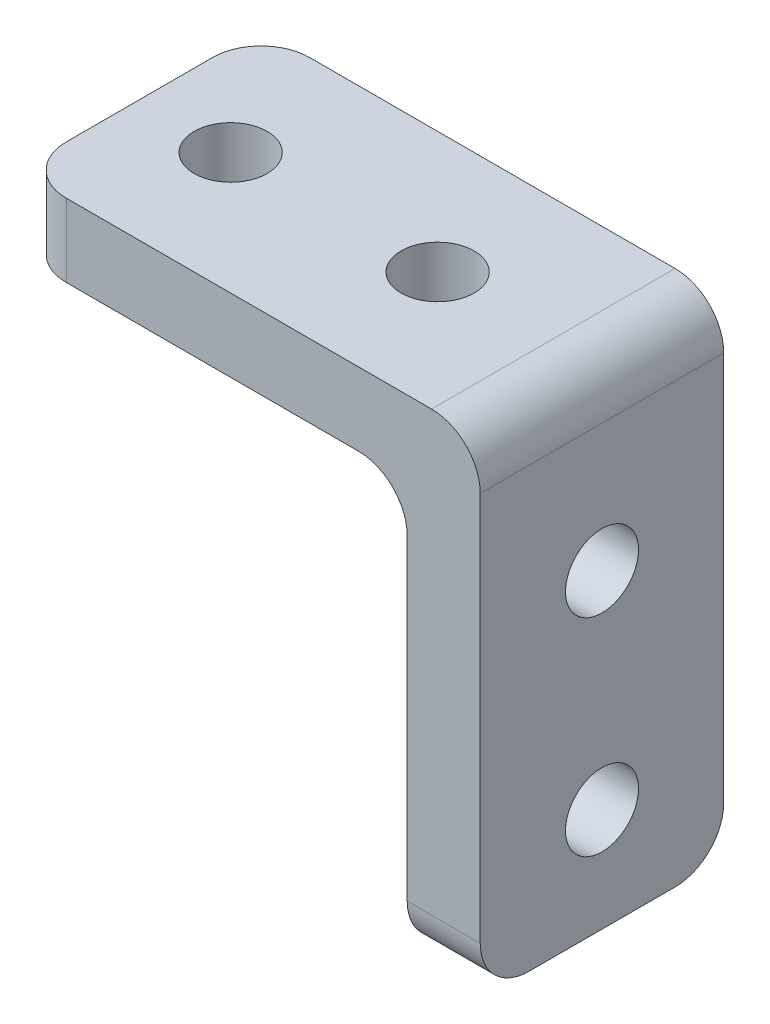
ISO-10303-21;
HEADER;
FILE_DESCRIPTION(('STEP AP214'),'2;1');
FILE_NAME('part.step','',(''),(''),'','','');
FILE_SCHEMA(('AUTOMOTIVE_DESIGN { 1 0 10303 214 1 1 1 1 }'));
ENDSEC;
DATA;
#1=APPLICATION_CONTEXT('core data for automotive mechanical design processes');
#2=APPLICATION_PROTOCOL_DEFINITION('international standard','automotive_design',2000,#1);
#3=PRODUCT_CONTEXT('',#1,'mechanical');
#4=PRODUCT('Part','Part','',(#3));
#5=PRODUCT_RELATED_PRODUCT_CATEGORY('part','',(#4));
#6=PRODUCT_DEFINITION_FORMATION('','',#4);
#7=PRODUCT_DEFINITION_CONTEXT('part definition',#1,'design');
#8=PRODUCT_DEFINITION('design','',#6,#7);
#9=PRODUCT_DEFINITION_SHAPE('','',#8);
#10=(LENGTH_UNIT() NAMED_UNIT(*) SI_UNIT(.MILLI.,.METRE.));
#11=(NAMED_UNIT(*) PLANE_ANGLE_UNIT() SI_UNIT($,.RADIAN.));
#12=(NAMED_UNIT(*) SI_UNIT($,.STERADIAN.) SOLID_ANGLE_UNIT());
#13=UNCERTAINTY_MEASURE_WITH_UNIT(LENGTH_MEASURE(1.E-05),#10,'distance_accuracy_value','');
#14=(GEOMETRIC_REPRESENTATION_CONTEXT(3) GLOBAL_UNCERTAINTY_ASSIGNED_CONTEXT((#13)) GLOBAL_UNIT_ASSIGNED_CONTEXT((#10,
#11,#12)) REPRESENTATION_CONTEXT('',''));
#15=CARTESIAN_POINT('',(0.,0.,0.));
#16=DIRECTION('',(0.,0.,1.));
#17=DIRECTION('',(1.,0.,0.));
#18=AXIS2_PLACEMENT_3D('',#15,#16,#17);
#19=CARTESIAN_POINT('',(0.,3.,0.));
#20=DIRECTION('',(0.,1.,0.));
#21=DIRECTION('',(0.,0.,1.));
#22=AXIS2_PLACEMENT_3D('',#19,#20,#21);
#23=PLANE('',#22);
#24=CARTESIAN_POINT('',(4.25,3.,0.));
#25=DIRECTION('',(0.,1.,0.));
#26=DIRECTION('',(0.,0.,1.));
#27=AXIS2_PLACEMENT_3D('',#24,#25,#26);
#28=CIRCLE('',#27,1.5);
#29=CARTESIAN_POINT('',(4.25,3.,1.5));
#30=VERTEX_POINT('',#29);
#31=EDGE_CURVE('E156',#30,#30,#28,.T.);
#32=ORIENTED_EDGE('',*,*,#31,.F.);
#33=EDGE_LOOP('',(#32));
#34=FACE_BOUND('',#33,.T.);
#35=DIRECTION('',(1.,0.,0.));
#36=VECTOR('',#35,1.);
#37=CARTESIAN_POINT('',(8.,3.,5.));
#38=LINE('',#37,#36);
#39=CARTESIAN_POINT('',(-6.,3.,5.));
#40=VERTEX_POINT('',#39);
#41=CARTESIAN_POINT('',(9.,3.,5.));
#42=VERTEX_POINT('',#41);
#43=EDGE_CURVE('E236',#40,#42,#38,.T.);
#44=ORIENTED_EDGE('',*,*,#43,.T.);
#45=DIRECTION('',(0.,0.,-1.));
#46=VECTOR('',#45,1.);
#47=CARTESIAN_POINT('',(9.,3.,0.));
#48=LINE('',#47,#46);
#49=CARTESIAN_POINT('',(9.,3.,-5.));
#50=VERTEX_POINT('',#49);
#51=EDGE_CURVE('E227',#42,#50,#48,.T.);
#52=ORIENTED_EDGE('',*,*,#51,.T.);
#53=DIRECTION('',(-1.,0.,0.));
#54=VECTOR('',#53,1.);
#55=CARTESIAN_POINT('',(8.,3.,-5.));
#56=LINE('',#55,#54);
#57=CARTESIAN_POINT('',(-6.,3.,-5.));
#58=VERTEX_POINT('',#57);
#59=EDGE_CURVE('E164',#50,#58,#56,.T.);
#60=ORIENTED_EDGE('',*,*,#59,.T.);
#61=CARTESIAN_POINT('',(-6.,3.,-3.));
#62=DIRECTION('',(0.,1.,0.));
#63=DIRECTION('',(0.,0.,1.));
#64=AXIS2_PLACEMENT_3D('',#61,#62,#63);
#65=CIRCLE('',#64,2.);
#66=CARTESIAN_POINT('',(-8.,3.,-3.));
#67=VERTEX_POINT('',#66);
#68=EDGE_CURVE('E225',#58,#67,#65,.T.);
#69=ORIENTED_EDGE('',*,*,#68,.T.);
#70=DIRECTION('',(0.,0.,1.));
#71=VECTOR('',#70,1.);
#72=CARTESIAN_POINT('',(-8.,3.,5.));
#73=LINE('',#72,#71);
#74=CARTESIAN_POINT('',(-8.,3.,3.));
#75=VERTEX_POINT('',#74);
#76=EDGE_CURVE('E138',#67,#75,#73,.T.);
#77=ORIENTED_EDGE('',*,*,#76,.T.);
#78=CARTESIAN_POINT('',(-6.,3.,3.));
#79=DIRECTION('',(0.,1.,0.));
#80=DIRECTION('',(0.,0.,1.));
#81=AXIS2_PLACEMENT_3D('',#78,#79,#80);
#82=CIRCLE('',#81,2.);
#83=EDGE_CURVE('E223',#75,#40,#82,.T.);
#84=ORIENTED_EDGE('',*,*,#83,.T.);
#85=EDGE_LOOP('',(#44,#52,#60,#69,#77,#84));
#86=FACE_BOUND('',#85,.T.);
#87=CARTESIAN_POINT('',(-4.25,3.,0.));
#88=DIRECTION('',(0.,1.,0.));
#89=DIRECTION('',(0.,0.,-1.));
#90=AXIS2_PLACEMENT_3D('',#87,#88,#89);
#91=CIRCLE('',#90,1.5);
#92=CARTESIAN_POINT('',(-4.25,3.,-1.5));
#93=VERTEX_POINT('',#92);
#94=EDGE_CURVE('E192',#93,#93,#91,.T.);
#95=ORIENTED_EDGE('',*,*,#94,.F.);
#96=EDGE_LOOP('',(#95));
#97=FACE_BOUND('',#96,.T.);
#98=ADVANCED_FACE('F32',(#34,#86,#97),#23,.T.);
#99=CARTESIAN_POINT('',(0.,0.,0.));
#100=DIRECTION('',(0.,1.,0.));
#101=DIRECTION('',(0.,0.,1.));
#102=AXIS2_PLACEMENT_3D('',#99,#100,#101);
#103=PLANE('',#102);
#104=CARTESIAN_POINT('',(4.25,0.,0.));
#105=DIRECTION('',(0.,1.,0.));
#106=DIRECTION('',(0.,0.,1.));
#107=AXIS2_PLACEMENT_3D('',#104,#105,#106);
#108=CIRCLE('',#107,1.5);
#109=CARTESIAN_POINT('',(4.25,0.,1.5));
#110=VERTEX_POINT('',#109);
#111=EDGE_CURVE('E160',#110,#110,#108,.T.);
#112=ORIENTED_EDGE('',*,*,#111,.T.);
#113=EDGE_LOOP('',(#112));
#114=FACE_BOUND('',#113,.T.);
#115=DIRECTION('',(-1.,0.,0.));
#116=VECTOR('',#115,1.);
#117=CARTESIAN_POINT('',(8.,0.,-5.));
#118=LINE('',#117,#116);
#119=CARTESIAN_POINT('',(6.,0.,-5.));
#120=VERTEX_POINT('',#119);
#121=CARTESIAN_POINT('',(-6.,0.,-5.));
#122=VERTEX_POINT('',#121);
#123=EDGE_CURVE('E125',#120,#122,#118,.T.);
#124=ORIENTED_EDGE('',*,*,#123,.F.);
#125=DIRECTION('',(0.,0.,-1.));
#126=VECTOR('',#125,1.);
#127=CARTESIAN_POINT('',(6.,0.,0.));
#128=LINE('',#127,#126);
#129=CARTESIAN_POINT('',(6.,0.,5.));
#130=VERTEX_POINT('',#129);
#131=EDGE_CURVE('E136',#120,#130,#128,.F.);
#132=ORIENTED_EDGE('',*,*,#131,.T.);
#133=DIRECTION('',(1.,0.,0.));
#134=VECTOR('',#133,1.);
#135=CARTESIAN_POINT('',(8.,0.,5.));
#136=LINE('',#135,#134);
#137=CARTESIAN_POINT('',(-6.,0.,5.));
#138=VERTEX_POINT('',#137);
#139=EDGE_CURVE('E139',#138,#130,#136,.T.);
#140=ORIENTED_EDGE('',*,*,#139,.F.);
#141=CARTESIAN_POINT('',(-6.,0.,3.));
#142=DIRECTION('',(0.,1.,0.));
#143=DIRECTION('',(0.,0.,1.));
#144=AXIS2_PLACEMENT_3D('',#141,#142,#143);
#145=CIRCLE('',#144,2.);
#146=CARTESIAN_POINT('',(-8.,0.,3.));
#147=VERTEX_POINT('',#146);
#148=EDGE_CURVE('E47',#138,#147,#145,.F.);
#149=ORIENTED_EDGE('',*,*,#148,.T.);
#150=DIRECTION('',(0.,0.,1.));
#151=VECTOR('',#150,1.);
#152=CARTESIAN_POINT('',(-8.,0.,5.));
#153=LINE('',#152,#151);
#154=CARTESIAN_POINT('',(-8.,0.,-3.));
#155=VERTEX_POINT('',#154);
#156=EDGE_CURVE('E152',#155,#147,#153,.T.);
#157=ORIENTED_EDGE('',*,*,#156,.F.);
#158=CARTESIAN_POINT('',(-6.,0.,-3.));
#159=DIRECTION('',(0.,1.,0.));
#160=DIRECTION('',(0.,0.,1.));
#161=AXIS2_PLACEMENT_3D('',#158,#159,#160);
#162=CIRCLE('',#161,2.);
#163=EDGE_CURVE('E55',#155,#122,#162,.F.);
#164=ORIENTED_EDGE('',*,*,#163,.T.);
#165=EDGE_LOOP('',(#124,#132,#140,#149,#157,#164));
#166=FACE_BOUND('',#165,.T.);
#167=CARTESIAN_POINT('',(-4.25,0.,0.));
#168=DIRECTION('',(0.,1.,0.));
#169=DIRECTION('',(0.,0.,-1.));
#170=AXIS2_PLACEMENT_3D('',#167,#168,#169);
#171=CIRCLE('',#170,1.5);
#172=CARTESIAN_POINT('',(-4.25,0.,-1.5));
#173=VERTEX_POINT('',#172);
#174=EDGE_CURVE('E175',#173,#173,#171,.T.);
#175=ORIENTED_EDGE('',*,*,#174,.T.);
#176=EDGE_LOOP('',(#175));
#177=FACE_BOUND('',#176,.T.);
#178=ADVANCED_FACE('F134',(#114,#166,#177),#103,.F.);
#179=CARTESIAN_POINT('',(-8.,3.,5.));
#180=DIRECTION('',(1.,0.,0.));
#181=DIRECTION('',(0.,0.,-1.));
#182=AXIS2_PLACEMENT_3D('',#179,#180,#181);
#183=PLANE('',#182);
#184=ORIENTED_EDGE('',*,*,#76,.F.);
#185=DIRECTION('',(0.,-1.,0.));
#186=VECTOR('',#185,1.);
#187=CARTESIAN_POINT('',(-8.,3.,-3.));
#188=LINE('',#187,#186);
#189=EDGE_CURVE('E133',#67,#155,#188,.T.);
#190=ORIENTED_EDGE('',*,*,#189,.T.);
#191=ORIENTED_EDGE('',*,*,#156,.T.);
#192=DIRECTION('',(0.,-1.,0.));
#193=VECTOR('',#192,1.);
#194=CARTESIAN_POINT('',(-8.,3.,3.));
#195=LINE('',#194,#193);
#196=EDGE_CURVE('E143',#147,#75,#195,.F.);
#197=ORIENTED_EDGE('',*,*,#196,.T.);
#198=EDGE_LOOP('',(#184,#190,#191,#197));
#199=FACE_BOUND('',#198,.T.);
#200=ADVANCED_FACE('F151',(#199),#183,.F.);
#201=CARTESIAN_POINT('',(8.,3.,5.));
#202=DIRECTION('',(0.,0.,-1.));
#203=DIRECTION('',(-1.,0.,0.));
#204=AXIS2_PLACEMENT_3D('',#201,#202,#203);
#205=PLANE('',#204);
#206=DIRECTION('',(0.,1.,0.));
#207=VECTOR('',#206,1.);
#208=CARTESIAN_POINT('',(8.,-17.,5.));
#209=LINE('',#208,#207);
#210=CARTESIAN_POINT('',(8.,-15.,5.));
#211=VERTEX_POINT('',#210);
#212=CARTESIAN_POINT('',(8.,-2.,5.));
#213=VERTEX_POINT('',#212);
#214=EDGE_CURVE('E189',#211,#213,#209,.T.);
#215=ORIENTED_EDGE('',*,*,#214,.F.);
#216=DIRECTION('',(1.,0.,0.));
#217=VECTOR('',#216,1.);
#218=CARTESIAN_POINT('',(8.,-15.,5.));
#219=LINE('',#218,#217);
#220=CARTESIAN_POINT('',(11.,-15.,5.));
#221=VERTEX_POINT('',#220);
#222=EDGE_CURVE('E220',#211,#221,#219,.T.);
#223=ORIENTED_EDGE('',*,*,#222,.T.);
#224=DIRECTION('',(0.,1.,0.));
#225=VECTOR('',#224,1.);
#226=CARTESIAN_POINT('',(11.,-17.,5.));
#227=LINE('',#226,#225);
#228=CARTESIAN_POINT('',(11.,1.,5.));
#229=VERTEX_POINT('',#228);
#230=EDGE_CURVE('E186',#221,#229,#227,.T.);
#231=ORIENTED_EDGE('',*,*,#230,.T.);
#232=CARTESIAN_POINT('',(9.,1.,5.));
#233=DIRECTION('',(0.,0.,-1.));
#234=DIRECTION('',(-1.,0.,0.));
#235=AXIS2_PLACEMENT_3D('',#232,#233,#234);
#236=CIRCLE('',#235,2.);
#237=EDGE_CURVE('E218',#229,#42,#236,.F.);
#238=ORIENTED_EDGE('',*,*,#237,.T.);
#239=ORIENTED_EDGE('',*,*,#43,.F.);
#240=DIRECTION('',(0.,-1.,0.));
#241=VECTOR('',#240,1.);
#242=CARTESIAN_POINT('',(-6.,3.,5.));
#243=LINE('',#242,#241);
#244=EDGE_CURVE('E214',#40,#138,#243,.T.);
#245=ORIENTED_EDGE('',*,*,#244,.T.);
#246=ORIENTED_EDGE('',*,*,#139,.T.);
#247=CARTESIAN_POINT('',(6.,-2.,5.));
#248=DIRECTION('',(0.,0.,-1.));
#249=DIRECTION('',(-1.,0.,0.));
#250=AXIS2_PLACEMENT_3D('',#247,#248,#249);
#251=CIRCLE('',#250,2.);
#252=EDGE_CURVE('E11',#130,#213,#251,.T.);
#253=ORIENTED_EDGE('',*,*,#252,.T.);
#254=EDGE_LOOP('',(#215,#223,#231,#238,#239,#245,#246,#253));
#255=FACE_BOUND('',#254,.T.);
#256=ADVANCED_FACE('F265',(#255),#205,.F.);
#257=CARTESIAN_POINT('',(8.,3.,-5.));
#258=DIRECTION('',(0.,0.,1.));
#259=DIRECTION('',(1.,0.,0.));
#260=AXIS2_PLACEMENT_3D('',#257,#258,#259);
#261=PLANE('',#260);
#262=DIRECTION('',(0.,1.,0.));
#263=VECTOR('',#262,1.);
#264=CARTESIAN_POINT('',(11.,-17.,-5.));
#265=LINE('',#264,#263);
#266=CARTESIAN_POINT('',(11.,-15.,-5.));
#267=VERTEX_POINT('',#266);
#268=CARTESIAN_POINT('',(11.,1.,-5.));
#269=VERTEX_POINT('',#268);
#270=EDGE_CURVE('E176',#267,#269,#265,.T.);
#271=ORIENTED_EDGE('',*,*,#270,.F.);
#272=DIRECTION('',(-1.,0.,0.));
#273=VECTOR('',#272,1.);
#274=CARTESIAN_POINT('',(8.,-15.,-5.));
#275=LINE('',#274,#273);
#276=CARTESIAN_POINT('',(8.,-15.,-5.));
#277=VERTEX_POINT('',#276);
#278=EDGE_CURVE('E198',#267,#277,#275,.T.);
#279=ORIENTED_EDGE('',*,*,#278,.T.);
#280=DIRECTION('',(0.,1.,0.));
#281=VECTOR('',#280,1.);
#282=CARTESIAN_POINT('',(8.,-17.,-5.));
#283=LINE('',#282,#281);
#284=CARTESIAN_POINT('',(8.,-2.,-5.));
#285=VERTEX_POINT('',#284);
#286=EDGE_CURVE('E128',#277,#285,#283,.T.);
#287=ORIENTED_EDGE('',*,*,#286,.T.);
#288=CARTESIAN_POINT('',(6.,-2.,-5.));
#289=DIRECTION('',(0.,0.,1.));
#290=DIRECTION('',(1.,0.,0.));
#291=AXIS2_PLACEMENT_3D('',#288,#289,#290);
#292=CIRCLE('',#291,2.);
#293=EDGE_CURVE('E40',#285,#120,#292,.T.);
#294=ORIENTED_EDGE('',*,*,#293,.T.);
#295=ORIENTED_EDGE('',*,*,#123,.T.);
#296=DIRECTION('',(0.,-1.,0.));
#297=VECTOR('',#296,1.);
#298=CARTESIAN_POINT('',(-6.,3.,-5.));
#299=LINE('',#298,#297);
#300=EDGE_CURVE('E177',#122,#58,#299,.F.);
#301=ORIENTED_EDGE('',*,*,#300,.T.);
#302=ORIENTED_EDGE('',*,*,#59,.F.);
#303=CARTESIAN_POINT('',(9.,1.,-5.));
#304=DIRECTION('',(0.,0.,1.));
#305=DIRECTION('',(1.,0.,0.));
#306=AXIS2_PLACEMENT_3D('',#303,#304,#305);
#307=CIRCLE('',#306,2.);
#308=EDGE_CURVE('E239',#50,#269,#307,.F.);
#309=ORIENTED_EDGE('',*,*,#308,.T.);
#310=EDGE_LOOP('',(#271,#279,#287,#294,#295,#301,#302,#309));
#311=FACE_BOUND('',#310,.T.);
#312=ADVANCED_FACE('F124',(#311),#261,.F.);
#313=CARTESIAN_POINT('',(4.25,3.,0.));
#314=DIRECTION('',(0.,-1.,0.));
#315=DIRECTION('',(0.,0.,-1.));
#316=AXIS2_PLACEMENT_3D('',#313,#314,#315);
#317=CYLINDRICAL_SURFACE('',#316,1.5);
#318=ORIENTED_EDGE('',*,*,#31,.T.);
#319=EDGE_LOOP('',(#318));
#320=FACE_BOUND('',#319,.T.);
#321=ORIENTED_EDGE('',*,*,#111,.F.);
#322=EDGE_LOOP('',(#321));
#323=FACE_BOUND('',#322,.T.);
#324=ADVANCED_FACE('F260',(#320,#323),#317,.F.);
#325=CARTESIAN_POINT('',(-4.25,3.,0.));
#326=DIRECTION('',(0.,-1.,0.));
#327=DIRECTION('',(0.,0.,-1.));
#328=AXIS2_PLACEMENT_3D('',#325,#326,#327);
#329=CYLINDRICAL_SURFACE('',#328,1.5);
#330=ORIENTED_EDGE('',*,*,#94,.T.);
#331=EDGE_LOOP('',(#330));
#332=FACE_BOUND('',#331,.T.);
#333=ORIENTED_EDGE('',*,*,#174,.F.);
#334=EDGE_LOOP('',(#333));
#335=FACE_BOUND('',#334,.T.);
#336=ADVANCED_FACE('F248',(#332,#335),#329,.F.);
#337=CARTESIAN_POINT('',(8.,-17.,-5.));
#338=DIRECTION('',(-1.,0.,0.));
#339=DIRECTION('',(0.,0.,1.));
#340=AXIS2_PLACEMENT_3D('',#337,#338,#339);
#341=PLANE('',#340);
#342=CARTESIAN_POINT('',(8.,-4.25,0.));
#343=DIRECTION('',(-1.,0.,0.));
#344=DIRECTION('',(0.,0.,-1.));
#345=AXIS2_PLACEMENT_3D('',#342,#343,#344);
#346=CIRCLE('',#345,1.5);
#347=CARTESIAN_POINT('',(8.,-4.25,-1.5));
#348=VERTEX_POINT('',#347);
#349=EDGE_CURVE('E317',#348,#348,#346,.T.);
#350=ORIENTED_EDGE('',*,*,#349,.F.);
#351=EDGE_LOOP('',(#350));
#352=FACE_BOUND('',#351,.T.);
#353=CARTESIAN_POINT('',(8.,-12.75,0.));
#354=DIRECTION('',(-1.,0.,0.));
#355=DIRECTION('',(0.,0.,1.));
#356=AXIS2_PLACEMENT_3D('',#353,#354,#355);
#357=CIRCLE('',#356,1.5);
#358=CARTESIAN_POINT('',(8.,-12.75,1.5));
#359=VERTEX_POINT('',#358);
#360=EDGE_CURVE('E313',#359,#359,#357,.T.);
#361=ORIENTED_EDGE('',*,*,#360,.F.);
#362=EDGE_LOOP('',(#361));
#363=FACE_BOUND('',#362,.T.);
#364=ORIENTED_EDGE('',*,*,#286,.F.);
#365=CARTESIAN_POINT('',(8.,-15.,-3.));
#366=DIRECTION('',(-1.,0.,0.));
#367=DIRECTION('',(0.,0.,1.));
#368=AXIS2_PLACEMENT_3D('',#365,#366,#367);
#369=CIRCLE('',#368,2.);
#370=CARTESIAN_POINT('',(8.,-17.,-3.));
#371=VERTEX_POINT('',#370);
#372=EDGE_CURVE('E203',#277,#371,#369,.T.);
#373=ORIENTED_EDGE('',*,*,#372,.T.);
#374=DIRECTION('',(0.,0.,1.));
#375=VECTOR('',#374,1.);
#376=CARTESIAN_POINT('',(8.,-17.,-5.));
#377=LINE('',#376,#375);
#378=CARTESIAN_POINT('',(8.,-17.,3.));
#379=VERTEX_POINT('',#378);
#380=EDGE_CURVE('E305',#371,#379,#377,.T.);
#381=ORIENTED_EDGE('',*,*,#380,.T.);
#382=CARTESIAN_POINT('',(8.,-15.,3.));
#383=DIRECTION('',(-1.,0.,0.));
#384=DIRECTION('',(0.,0.,1.));
#385=AXIS2_PLACEMENT_3D('',#382,#383,#384);
#386=CIRCLE('',#385,2.);
#387=EDGE_CURVE('E201',#379,#211,#386,.T.);
#388=ORIENTED_EDGE('',*,*,#387,.T.);
#389=ORIENTED_EDGE('',*,*,#214,.T.);
#390=DIRECTION('',(0.,0.,-1.));
#391=VECTOR('',#390,1.);
#392=CARTESIAN_POINT('',(8.,-2.,-5.));
#393=LINE('',#392,#391);
#394=EDGE_CURVE('E199',#213,#285,#393,.T.);
#395=ORIENTED_EDGE('',*,*,#394,.T.);
#396=EDGE_LOOP('',(#364,#373,#381,#388,#389,#395));
#397=FACE_BOUND('',#396,.T.);
#398=ADVANCED_FACE('F304',(#352,#363,#397),#341,.T.);
#399=CARTESIAN_POINT('',(11.,-17.,-5.));
#400=DIRECTION('',(1.,0.,0.));
#401=DIRECTION('',(0.,0.,-1.));
#402=AXIS2_PLACEMENT_3D('',#399,#400,#401);
#403=PLANE('',#402);
#404=CARTESIAN_POINT('',(11.,-4.25,0.));
#405=DIRECTION('',(1.,0.,0.));
#406=DIRECTION('',(0.,0.,-1.));
#407=AXIS2_PLACEMENT_3D('',#404,#405,#406);
#408=CIRCLE('',#407,1.5);
#409=CARTESIAN_POINT('',(11.,-4.25,-1.5));
#410=VERTEX_POINT('',#409);
#411=EDGE_CURVE('E172',#410,#410,#408,.T.);
#412=ORIENTED_EDGE('',*,*,#411,.F.);
#413=EDGE_LOOP('',(#412));
#414=FACE_BOUND('',#413,.T.);
#415=CARTESIAN_POINT('',(11.,-12.75,0.));
#416=DIRECTION('',(1.,0.,0.));
#417=DIRECTION('',(0.,0.,-1.));
#418=AXIS2_PLACEMENT_3D('',#415,#416,#417);
#419=CIRCLE('',#418,1.5);
#420=CARTESIAN_POINT('',(11.,-12.75,-1.5));
#421=VERTEX_POINT('',#420);
#422=EDGE_CURVE('E311',#421,#421,#419,.T.);
#423=ORIENTED_EDGE('',*,*,#422,.F.);
#424=EDGE_LOOP('',(#423));
#425=FACE_BOUND('',#424,.T.);
#426=DIRECTION('',(0.,0.,-1.));
#427=VECTOR('',#426,1.);
#428=CARTESIAN_POINT('',(11.,-17.,-5.));
#429=LINE('',#428,#427);
#430=CARTESIAN_POINT('',(11.,-17.,3.));
#431=VERTEX_POINT('',#430);
#432=CARTESIAN_POINT('',(11.,-17.,-3.));
#433=VERTEX_POINT('',#432);
#434=EDGE_CURVE('E182',#431,#433,#429,.T.);
#435=ORIENTED_EDGE('',*,*,#434,.T.);
#436=CARTESIAN_POINT('',(11.,-15.,-3.));
#437=DIRECTION('',(1.,0.,0.));
#438=DIRECTION('',(0.,0.,-1.));
#439=AXIS2_PLACEMENT_3D('',#436,#437,#438);
#440=CIRCLE('',#439,2.);
#441=EDGE_CURVE('E213',#433,#267,#440,.T.);
#442=ORIENTED_EDGE('',*,*,#441,.T.);
#443=ORIENTED_EDGE('',*,*,#270,.T.);
#444=DIRECTION('',(0.,0.,-1.));
#445=VECTOR('',#444,1.);
#446=CARTESIAN_POINT('',(11.,1.,-5.));
#447=LINE('',#446,#445);
#448=EDGE_CURVE('E209',#269,#229,#447,.F.);
#449=ORIENTED_EDGE('',*,*,#448,.T.);
#450=ORIENTED_EDGE('',*,*,#230,.F.);
#451=CARTESIAN_POINT('',(11.,-15.,3.));
#452=DIRECTION('',(1.,0.,0.));
#453=DIRECTION('',(0.,0.,-1.));
#454=AXIS2_PLACEMENT_3D('',#451,#452,#453);
#455=CIRCLE('',#454,2.);
#456=EDGE_CURVE('E211',#221,#431,#455,.T.);
#457=ORIENTED_EDGE('',*,*,#456,.T.);
#458=EDGE_LOOP('',(#435,#442,#443,#449,#450,#457));
#459=FACE_BOUND('',#458,.T.);
#460=ADVANCED_FACE('F297',(#414,#425,#459),#403,.T.);
#461=CARTESIAN_POINT('',(0.,-17.,0.));
#462=DIRECTION('',(0.,1.,0.));
#463=DIRECTION('',(0.,0.,1.));
#464=AXIS2_PLACEMENT_3D('',#461,#462,#463);
#465=PLANE('',#464);
#466=ORIENTED_EDGE('',*,*,#380,.F.);
#467=DIRECTION('',(-1.,0.,0.));
#468=VECTOR('',#467,1.);
#469=CARTESIAN_POINT('',(0.,-17.,-3.));
#470=LINE('',#469,#468);
#471=EDGE_CURVE('E207',#371,#433,#470,.F.);
#472=ORIENTED_EDGE('',*,*,#471,.T.);
#473=ORIENTED_EDGE('',*,*,#434,.F.);
#474=DIRECTION('',(1.,0.,0.));
#475=VECTOR('',#474,1.);
#476=CARTESIAN_POINT('',(0.,-17.,3.));
#477=LINE('',#476,#475);
#478=EDGE_CURVE('E205',#431,#379,#477,.F.);
#479=ORIENTED_EDGE('',*,*,#478,.T.);
#480=EDGE_LOOP('',(#466,#472,#473,#479));
#481=FACE_BOUND('',#480,.T.);
#482=ADVANCED_FACE('F308',(#481),#465,.F.);
#483=CARTESIAN_POINT('',(28.,-12.75,0.));
#484=DIRECTION('',(-1.,0.,0.));
#485=DIRECTION('',(0.,0.,1.));
#486=AXIS2_PLACEMENT_3D('',#483,#484,#485);
#487=CYLINDRICAL_SURFACE('',#486,1.5);
#488=ORIENTED_EDGE('',*,*,#422,.T.);
#489=EDGE_LOOP('',(#488));
#490=FACE_BOUND('',#489,.T.);
#491=ORIENTED_EDGE('',*,*,#360,.T.);
#492=EDGE_LOOP('',(#491));
#493=FACE_BOUND('',#492,.T.);
#494=ADVANCED_FACE('F330',(#490,#493),#487,.F.);
#495=CARTESIAN_POINT('',(28.,-4.25,0.));
#496=DIRECTION('',(-1.,0.,0.));
#497=DIRECTION('',(0.,0.,1.));
#498=AXIS2_PLACEMENT_3D('',#495,#496,#497);
#499=CYLINDRICAL_SURFACE('',#498,1.5);
#500=ORIENTED_EDGE('',*,*,#411,.T.);
#501=EDGE_LOOP('',(#500));
#502=FACE_BOUND('',#501,.T.);
#503=ORIENTED_EDGE('',*,*,#349,.T.);
#504=EDGE_LOOP('',(#503));
#505=FACE_BOUND('',#504,.T.);
#506=ADVANCED_FACE('F275',(#502,#505),#499,.F.);
#507=CARTESIAN_POINT('',(8.,-15.,-3.));
#508=DIRECTION('',(-1.,0.,0.));
#509=DIRECTION('',(0.,0.,1.));
#510=AXIS2_PLACEMENT_3D('',#507,#508,#509);
#511=CYLINDRICAL_SURFACE('',#510,2.);
#512=ORIENTED_EDGE('',*,*,#441,.F.);
#513=ORIENTED_EDGE('',*,*,#471,.F.);
#514=ORIENTED_EDGE('',*,*,#372,.F.);
#515=ORIENTED_EDGE('',*,*,#278,.F.);
#516=EDGE_LOOP('',(#512,#513,#514,#515));
#517=FACE_BOUND('',#516,.T.);
#518=ADVANCED_FACE('F271',(#517),#511,.T.);
#519=CARTESIAN_POINT('',(8.,-15.,3.));
#520=DIRECTION('',(1.,0.,0.));
#521=DIRECTION('',(0.,0.,-1.));
#522=AXIS2_PLACEMENT_3D('',#519,#520,#521);
#523=CYLINDRICAL_SURFACE('',#522,2.);
#524=ORIENTED_EDGE('',*,*,#387,.F.);
#525=ORIENTED_EDGE('',*,*,#478,.F.);
#526=ORIENTED_EDGE('',*,*,#456,.F.);
#527=ORIENTED_EDGE('',*,*,#222,.F.);
#528=EDGE_LOOP('',(#524,#525,#526,#527));
#529=FACE_BOUND('',#528,.T.);
#530=ADVANCED_FACE('F274',(#529),#523,.T.);
#531=CARTESIAN_POINT('',(9.,1.,0.));
#532=DIRECTION('',(0.,0.,-1.));
#533=DIRECTION('',(-1.,0.,0.));
#534=AXIS2_PLACEMENT_3D('',#531,#532,#533);
#535=CYLINDRICAL_SURFACE('',#534,2.);
#536=ORIENTED_EDGE('',*,*,#237,.F.);
#537=ORIENTED_EDGE('',*,*,#448,.F.);
#538=ORIENTED_EDGE('',*,*,#308,.F.);
#539=ORIENTED_EDGE('',*,*,#51,.F.);
#540=EDGE_LOOP('',(#536,#537,#538,#539));
#541=FACE_BOUND('',#540,.T.);
#542=ADVANCED_FACE('F279',(#541),#535,.T.);
#543=CARTESIAN_POINT('',(6.,-2.,-5.));
#544=DIRECTION('',(0.,0.,-1.));
#545=DIRECTION('',(-1.,0.,0.));
#546=AXIS2_PLACEMENT_3D('',#543,#544,#545);
#547=CYLINDRICAL_SURFACE('',#546,2.);
#548=ORIENTED_EDGE('',*,*,#252,.F.);
#549=ORIENTED_EDGE('',*,*,#131,.F.);
#550=ORIENTED_EDGE('',*,*,#293,.F.);
#551=ORIENTED_EDGE('',*,*,#394,.F.);
#552=EDGE_LOOP('',(#548,#549,#550,#551));
#553=FACE_BOUND('',#552,.T.);
#554=ADVANCED_FACE('F142',(#553),#547,.F.);
#555=CARTESIAN_POINT('',(-6.,3.,-3.));
#556=DIRECTION('',(0.,-1.,0.));
#557=DIRECTION('',(0.,0.,-1.));
#558=AXIS2_PLACEMENT_3D('',#555,#556,#557);
#559=CYLINDRICAL_SURFACE('',#558,2.);
#560=ORIENTED_EDGE('',*,*,#68,.F.);
#561=ORIENTED_EDGE('',*,*,#300,.F.);
#562=ORIENTED_EDGE('',*,*,#163,.F.);
#563=ORIENTED_EDGE('',*,*,#189,.F.);
#564=EDGE_LOOP('',(#560,#561,#562,#563));
#565=FACE_BOUND('',#564,.T.);
#566=ADVANCED_FACE('F284',(#565),#559,.T.);
#567=CARTESIAN_POINT('',(-6.,3.,3.));
#568=DIRECTION('',(0.,-1.,0.));
#569=DIRECTION('',(0.,0.,-1.));
#570=AXIS2_PLACEMENT_3D('',#567,#568,#569);
#571=CYLINDRICAL_SURFACE('',#570,2.);
#572=ORIENTED_EDGE('',*,*,#83,.F.);
#573=ORIENTED_EDGE('',*,*,#196,.F.);
#574=ORIENTED_EDGE('',*,*,#148,.F.);
#575=ORIENTED_EDGE('',*,*,#244,.F.);
#576=EDGE_LOOP('',(#572,#573,#574,#575));
#577=FACE_BOUND('',#576,.T.);
#578=ADVANCED_FACE('F34',(#577),#571,.T.);
#579=CLOSED_SHELL('',(#98,#178,#200,#256,#312,#324,#336,#398,#460,#482,#494,#506,#518,#530,#542,
#554,#566,#578));
#580=MANIFOLD_SOLID_BREP('B2',#579);
#581=ADVANCED_BREP_SHAPE_REPRESENTATION('',(#18,#580),#14);
#582=SHAPE_DEFINITION_REPRESENTATION(#9,#581);
ENDSEC;
END-ISO-10303-21;
